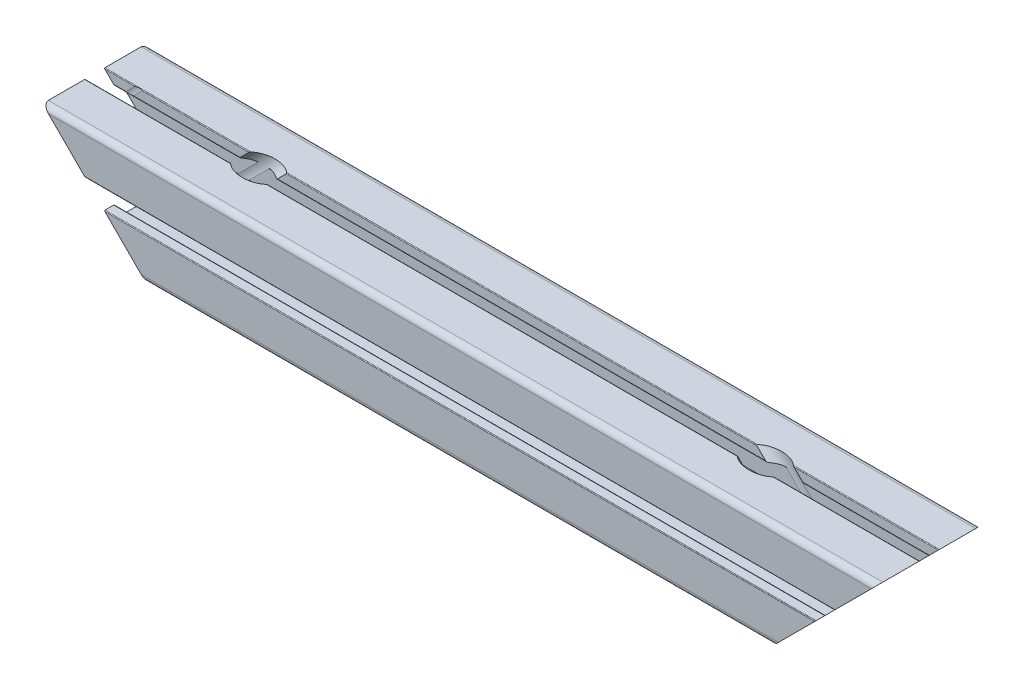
from build123d import *

# Parameters (mm, degrees)
MODEL_R                                 = 5.85
F_45_SARJA_1_0023_45X45_1_DEPTH         = 360
CUT_EXTRUDE1_DEPTH                      = 364.498624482
CUT_EXTRUDE2_DEPTH                      = 364.498624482
CBORE_FOR_M8_HEX_HEAD_BOLT4_D           = 8.4
CBORE_FOR_M8_HEX_HEAD_BOLT4_CBORE_D     = 14
CBORE_FOR_M8_HEX_HEAD_BOLT4_CBORE_DEPTH = 32.5
F_8_5_8_5_DIAMETER_HOLE2_D              = 8.5


with BuildPart() as part:
    # Model → 45-sarja 1.0023 45X45_1 (new body)
    with BuildSketch(Plane.ZY):
        with BuildLine():
            Line((22.5, -20), (22.5, -4.4))
            ThreePointArc((22.5, -4.4), (22.412132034, -4.187867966), (22.2, -4.1))
            Line((22.2, -4.1), (18.5, -4.1))
            ThreePointArc((18.5, -4.1), (18.146446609, -4.246446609), (18, -4.6))
            Line((18, -4.6), (18, -6.5))
            ThreePointArc((18, -6.5), (17.912132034, -6.712132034), (17.7, -6.8))
            Line((17.7, -6.8), (9.2, -6.8))
            Line((9.2, -6.8), (7.2, -4.8))
            Line((7.2, -4.8), (7.2, 4.8))
            Line((7.2, 4.8), (9.2, 6.8))
            Line((9.2, 6.8), (17.7, 6.8))
            ThreePointArc((17.7, 6.8), (17.912132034, 6.712132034), (18, 6.5))
            Line((18, 6.5), (18, 4.6))
            ThreePointArc((18, 4.6), (18.146446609, 4.246446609), (18.5, 4.1))
            Line((18.5, 4.1), (22.2, 4.1))
            ThreePointArc((22.2, 4.1), (22.412132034, 4.187867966), (22.5, 4.4))
            Line((22.5, 4.4), (22.5, 20))
            ThreePointArc((22.5, 20), (21.767766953, 21.767766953), (20, 22.5))
            Line((20, 22.5), (4.4, 22.5))
            ThreePointArc((4.4, 22.5), (4.187867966, 22.412132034), (4.1, 22.2))
            Line((4.1, 22.2), (4.1, 18.5))
            ThreePointArc((4.1, 18.5), (4.246446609, 18.146446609), (4.6, 18))
            Line((4.6, 18), (6.5, 18))
            ThreePointArc((6.5, 18), (6.712132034, 17.912132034), (6.8, 17.7))
            Line((6.8, 17.7), (6.8, 9.2))
            Line((6.8, 9.2), (4.8, 7.2))
            Line((4.8, 7.2), (-4.8, 7.2))
            Line((-4.8, 7.2), (-6.8, 9.2))
            Line((-6.8, 9.2), (-6.8, 17.7))
            ThreePointArc((-6.8, 17.7), (-6.712132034, 17.912132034), (-6.5, 18))
            Line((-6.5, 18), (-4.6, 18))
            ThreePointArc((-4.6, 18), (-4.246446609, 18.146446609), (-4.1, 18.5))
            Line((-4.1, 18.5), (-4.1, 22.2))
            ThreePointArc((-4.1, 22.2), (-4.187867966, 22.412132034), (-4.4, 22.5))
            Line((-4.4, 22.5), (-20, 22.5))
            ThreePointArc((-20, 22.5), (-21.767766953, 21.767766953), (-22.5, 20))
            Line((-22.5, 20), (-22.5, 4.4))
            ThreePointArc((-22.5, 4.4), (-22.412132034, 4.187867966), (-22.2, 4.1))
            Line((-22.2, 4.1), (-18.5, 4.1))
            ThreePointArc((-18.5, 4.1), (-18.146446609, 4.246446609), (-18, 4.6))
            Line((-18, 4.6), (-18, 6.5))
            ThreePointArc((-18, 6.5), (-17.912132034, 6.712132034), (-17.7, 6.8))
            Line((-17.7, 6.8), (-9.2, 6.8))
            Line((-9.2, 6.8), (-7.2, 4.8))
            Line((-7.2, 4.8), (-7.2, -4.8))
            Line((-7.2, -4.8), (-9.2, -6.8))
            Line((-9.2, -6.8), (-17.7, -6.8))
            ThreePointArc((-17.7, -6.8), (-17.912132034, -6.712132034), (-18, -6.5))
            Line((-18, -6.5), (-18, -4.6))
            ThreePointArc((-18, -4.6), (-18.146446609, -4.246446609), (-18.5, -4.1))
            Line((-18.5, -4.1), (-22.2, -4.1))
            ThreePointArc((-22.2, -4.1), (-22.412132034, -4.187867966), (-22.5, -4.4))
            Line((-22.5, -4.4), (-22.5, -20))
            ThreePointArc((-22.5, -20), (-21.767766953, -21.767766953), (-20, -22.5))
            Line((-20, -22.5), (-4.4, -22.5))
            ThreePointArc((-4.4, -22.5), (-4.187867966, -22.412132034), (-4.1, -22.2))
            Line((-4.1, -22.2), (-4.1, -18.5))
            ThreePointArc((-4.1, -18.5), (-4.246446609, -18.146446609), (-4.6, -18))
            Line((-4.6, -18), (-6.5, -18))
            ThreePointArc((-6.5, -18), (-6.712132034, -17.912132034), (-6.8, -17.7))
            Line((-6.8, -17.7), (-6.8, -9.2))
            Line((-6.8, -9.2), (-4.8, -7.2))
            Line((-4.8, -7.2), (4.8, -7.2))
            Line((4.8, -7.2), (6.8, -9.2))
            Line((6.8, -9.2), (6.8, -17.7))
            ThreePointArc((6.8, -17.7), (6.712132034, -17.912132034), (6.5, -18))
            Line((6.5, -18), (4.6, -18))
            ThreePointArc((4.6, -18), (4.246446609, -18.146446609), (4.1, -18.5))
            Line((4.1, -18.5), (4.1, -22.2))
            ThreePointArc((4.1, -22.2), (4.187867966, -22.412132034), (4.4, -22.5))
            Line((4.4, -22.5), (20, -22.5))
            ThreePointArc((20, -22.5), (21.767766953, -21.767766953), (22.5, -20))
        make_face()
        with Locations((14.65, 14.65)):
            Circle(MODEL_R, mode=Mode.SUBTRACT)
        with Locations((-14.65, -14.65)):
            Circle(MODEL_R, mode=Mode.SUBTRACT)
        with Locations((14.65, -14.65)):
            Circle(MODEL_R, mode=Mode.SUBTRACT)
        with Locations((-14.65, 14.65)):
            Circle(MODEL_R, mode=Mode.SUBTRACT)
        with BuildLine():
            Line((3.363290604, 1.949077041), (4.384062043, 2.969848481))
            ThreePointArc((4.384062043, 2.969848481), (4.471930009, 3.181980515), (4.384062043, 3.39411255))
            Line((4.384062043, 3.39411255), (3.39411255, 4.384062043))
            ThreePointArc((3.39411255, 4.384062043), (3.181980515, 4.471930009), (2.969848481, 4.384062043))
            Line((2.969848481, 4.384062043), (1.949077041, 3.363290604))
            ThreePointArc((1.949077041, 3.363290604), (1.786690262, 3.279575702), (1.605854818, 3.30557942))
            ThreePointArc((1.605854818, 3.30557942), (0, 3.675), (-1.605854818, 3.30557942))
            ThreePointArc((-1.605854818, 3.30557942), (-1.786690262, 3.279575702), (-1.949077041, 3.363290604))
            Line((-1.949077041, 3.363290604), (-2.969848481, 4.384062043))
            ThreePointArc((-2.969848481, 4.384062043), (-3.181980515, 4.471930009), (-3.39411255, 4.384062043))
            Line((-3.39411255, 4.384062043), (-4.384062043, 3.39411255))
            ThreePointArc((-4.384062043, 3.39411255), (-4.471930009, 3.181980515), (-4.384062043, 2.969848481))
            Line((-4.384062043, 2.969848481), (-3.363290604, 1.949077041))
            ThreePointArc((-3.363290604, 1.949077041), (-3.279575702, 1.786690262), (-3.30557942, 1.605854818))
            ThreePointArc((-3.30557942, 1.605854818), (-3.675, 0), (-3.30557942, -1.605854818))
            ThreePointArc((-3.30557942, -1.605854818), (-3.279575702, -1.786690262), (-3.363290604, -1.949077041))
            Line((-3.363290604, -1.949077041), (-4.384062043, -2.969848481))
            ThreePointArc((-4.384062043, -2.969848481), (-4.471930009, -3.181980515), (-4.384062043, -3.39411255))
            Line((-4.384062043, -3.39411255), (-3.39411255, -4.384062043))
            ThreePointArc((-3.39411255, -4.384062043), (-3.181980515, -4.471930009), (-2.969848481, -4.384062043))
            Line((-2.969848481, -4.384062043), (-1.949077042, -3.363290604))
            ThreePointArc((-1.949077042, -3.363290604), (-1.786690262, -3.279575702), (-1.605854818, -3.30557942))
            ThreePointArc((-1.605854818, -3.30557942), (0, -3.675), (1.605854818, -3.30557942))
            ThreePointArc((1.605854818, -3.30557942), (1.786690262, -3.279575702), (1.949077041, -3.363290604))
            Line((1.949077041, -3.363290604), (2.969848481, -4.384062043))
            ThreePointArc((2.969848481, -4.384062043), (3.181980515, -4.471930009), (3.39411255, -4.384062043))
            Line((3.39411255, -4.384062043), (4.384062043, -3.39411255))
            ThreePointArc((4.384062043, -3.39411255), (4.471930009, -3.181980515), (4.384062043, -2.969848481))
            Line((4.384062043, -2.969848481), (3.363290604, -1.949077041))
            ThreePointArc((3.363290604, -1.949077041), (3.279575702, -1.786690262), (3.30557942, -1.605854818))
            ThreePointArc((3.30557942, -1.605854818), (3.675, 0), (3.30557942, 1.605854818))
            ThreePointArc((3.30557942, 1.605854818), (3.279575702, 1.786690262), (3.363290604, 1.949077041))
        make_face(mode=Mode.SUBTRACT)
    extrude(amount=F_45_SARJA_1_0023_45X45_1_DEPTH)

    # Sketch3 → Cut-Extrude1 (cut, through all)
    with BuildSketch(Plane.XY.offset(22.5)):
        Polygon((0, 22.5), (-45, -22.5), (10.398687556, -32.898687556), align=None)
    extrude(amount=-CUT_EXTRUDE1_DEPTH, mode=Mode.SUBTRACT)

    # Sketch4 → Cut-Extrude2 (cut, through all)
    with BuildSketch(Plane.XY.offset(22.5)):
        Polygon((-360, 22.5), (-315, -22.5), (-360, -22.5), align=None)
    extrude(amount=-CUT_EXTRUDE2_DEPTH, mode=Mode.SUBTRACT)

    # CBORE for M8 Hex Head Bolt4 (through all)
    with Locations(Plane(origin=(-51.555086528, 51.555086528, 0), x_dir=(0, 0, -1), z_dir=(-0.7071067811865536, 0.7071067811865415, 0))):
        with Locations((0, 34.090097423)):
            cbore_for_m8_hex_head_bolt4 = CounterBoreHole(CBORE_FOR_M8_HEX_HEAD_BOLT4_D / 2, CBORE_FOR_M8_HEX_HEAD_BOLT4_CBORE_D / 2, CBORE_FOR_M8_HEX_HEAD_BOLT4_CBORE_DEPTH)

    # 8.5 _8.5_ Diameter Hole2 (through all)
    with Locations(Plane(origin=(-168.75, -168.75, 0), x_dir=(0, 0, 1), z_dir=(-0.7071067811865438, -0.7071067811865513, 0))):
        with Locations((0, 259.861742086)):
            Hole(F_8_5_8_5_DIAMETER_HOLE2_D / 2)

    # Mirror1: CBORE for M8 Hex Head Bolt4 across plane
    add(cbore_for_m8_hex_head_bolt4.mirror(Plane(origin=(-180, 0, 0), x_dir=(0, 0, 1), z_dir=(1, 0, 0))), mode=Mode.SUBTRACT)


solid = part.part
